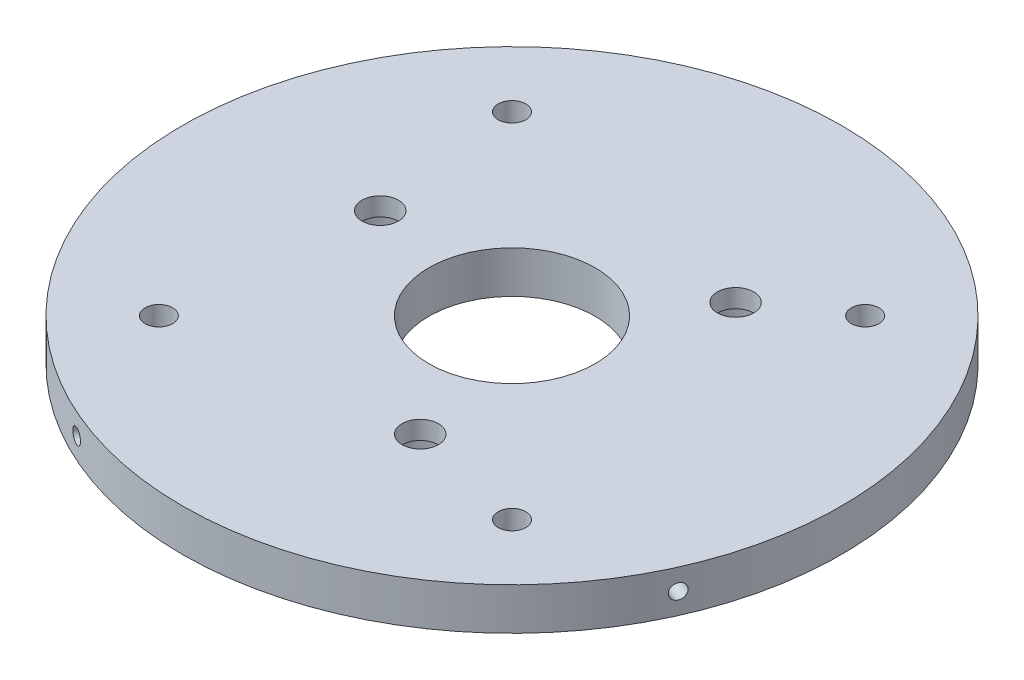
ISO-10303-21;
HEADER;
FILE_DESCRIPTION(('STEP AP214'),'2;1');
FILE_NAME('part.step','',(''),(''),'','','');
FILE_SCHEMA(('AUTOMOTIVE_DESIGN { 1 0 10303 214 1 1 1 1 }'));
ENDSEC;
DATA;
#1=APPLICATION_CONTEXT('core data for automotive mechanical design processes');
#2=APPLICATION_PROTOCOL_DEFINITION('international standard','automotive_design',2000,#1);
#3=PRODUCT_CONTEXT('',#1,'mechanical');
#4=PRODUCT('Part','Part','',(#3));
#5=PRODUCT_RELATED_PRODUCT_CATEGORY('part','',(#4));
#6=PRODUCT_DEFINITION_FORMATION('','',#4);
#7=PRODUCT_DEFINITION_CONTEXT('part definition',#1,'design');
#8=PRODUCT_DEFINITION('design','',#6,#7);
#9=PRODUCT_DEFINITION_SHAPE('','',#8);
#10=(LENGTH_UNIT() NAMED_UNIT(*) SI_UNIT(.MILLI.,.METRE.));
#11=(NAMED_UNIT(*) PLANE_ANGLE_UNIT() SI_UNIT($,.RADIAN.));
#12=(NAMED_UNIT(*) SI_UNIT($,.STERADIAN.) SOLID_ANGLE_UNIT());
#13=UNCERTAINTY_MEASURE_WITH_UNIT(LENGTH_MEASURE(1.E-05),#10,'distance_accuracy_value','');
#14=(GEOMETRIC_REPRESENTATION_CONTEXT(3) GLOBAL_UNCERTAINTY_ASSIGNED_CONTEXT((#13)) GLOBAL_UNIT_ASSIGNED_CONTEXT((#10,
#11,#12)) REPRESENTATION_CONTEXT('',''));
#15=CARTESIAN_POINT('',(0.,0.,0.));
#16=DIRECTION('',(0.,0.,1.));
#17=DIRECTION('',(1.,0.,0.));
#18=AXIS2_PLACEMENT_3D('',#15,#16,#17);
#19=CARTESIAN_POINT('',(0.,6.35,0.));
#20=DIRECTION('',(0.,1.,0.));
#21=DIRECTION('',(0.,0.,1.));
#22=AXIS2_PLACEMENT_3D('',#19,#20,#21);
#23=PLANE('',#22);
#24=CARTESIAN_POINT('',(15.1382985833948,6.35,-18.6234238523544));
#25=DIRECTION('',(0.,-1.,0.));
#26=DIRECTION('',(0.,0.,-1.));
#27=AXIS2_PLACEMENT_3D('',#24,#25,#26);
#28=CIRCLE('',#27,2.75);
#29=CARTESIAN_POINT('',(15.1382985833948,6.35,-21.3734238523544));
#30=VERTEX_POINT('',#29);
#31=EDGE_CURVE('E103',#30,#30,#28,.T.);
#32=ORIENTED_EDGE('',*,*,#31,.T.);
#33=EDGE_LOOP('',(#32));
#34=FACE_BOUND('',#33,.T.);
#35=CARTESIAN_POINT('',(8.55920886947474,6.35,22.4218630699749));
#36=DIRECTION('',(0.,-1.,0.));
#37=DIRECTION('',(0.,0.,-1.));
#38=AXIS2_PLACEMENT_3D('',#35,#36,#37);
#39=CIRCLE('',#38,2.75);
#40=CARTESIAN_POINT('',(8.55920886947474,6.35,19.6718630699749));
#41=VERTEX_POINT('',#40);
#42=EDGE_CURVE('E117',#41,#41,#39,.T.);
#43=ORIENTED_EDGE('',*,*,#42,.T.);
#44=EDGE_LOOP('',(#43));
#45=FACE_BOUND('',#44,.T.);
#46=CARTESIAN_POINT('',(-23.6975074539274,6.35,-3.79843921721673));
#47=DIRECTION('',(0.,-1.,0.));
#48=DIRECTION('',(0.,0.,-1.));
#49=AXIS2_PLACEMENT_3D('',#46,#47,#48);
#50=CIRCLE('',#49,2.75);
#51=CARTESIAN_POINT('',(-23.6975074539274,6.35,-6.54843921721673));
#52=VERTEX_POINT('',#51);
#53=EDGE_CURVE('E130',#52,#52,#50,.T.);
#54=ORIENTED_EDGE('',*,*,#53,.T.);
#55=EDGE_LOOP('',(#54));
#56=FACE_BOUND('',#55,.T.);
#57=CARTESIAN_POINT('',(-26.6700000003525,6.35,-26.6699999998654));
#58=DIRECTION('',(0.,1.,0.));
#59=DIRECTION('',(0.,0.,1.));
#60=AXIS2_PLACEMENT_3D('',#57,#58,#59);
#61=CIRCLE('',#60,2.0828);
#62=CARTESIAN_POINT('',(-26.6700000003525,6.35,-24.5871999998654));
#63=VERTEX_POINT('',#62);
#64=EDGE_CURVE('E133',#63,#63,#61,.T.);
#65=ORIENTED_EDGE('',*,*,#64,.F.);
#66=EDGE_LOOP('',(#65));
#67=FACE_BOUND('',#66,.T.);
#68=CARTESIAN_POINT('',(26.6699999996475,6.35,-26.6699999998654));
#69=DIRECTION('',(0.,1.,0.));
#70=DIRECTION('',(0.,0.,1.));
#71=AXIS2_PLACEMENT_3D('',#68,#69,#70);
#72=CIRCLE('',#71,2.0828);
#73=CARTESIAN_POINT('',(26.6699999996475,6.35,-24.5871999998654));
#74=VERTEX_POINT('',#73);
#75=EDGE_CURVE('E139',#74,#74,#72,.T.);
#76=ORIENTED_EDGE('',*,*,#75,.F.);
#77=EDGE_LOOP('',(#76));
#78=FACE_BOUND('',#77,.T.);
#79=CARTESIAN_POINT('',(-26.6700000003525,6.35,26.6700000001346));
#80=DIRECTION('',(0.,1.,0.));
#81=DIRECTION('',(0.,0.,1.));
#82=AXIS2_PLACEMENT_3D('',#79,#80,#81);
#83=CIRCLE('',#82,2.0828);
#84=CARTESIAN_POINT('',(-26.6700000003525,6.35,28.7528000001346));
#85=VERTEX_POINT('',#84);
#86=EDGE_CURVE('E145',#85,#85,#83,.T.);
#87=ORIENTED_EDGE('',*,*,#86,.F.);
#88=EDGE_LOOP('',(#87));
#89=FACE_BOUND('',#88,.T.);
#90=CARTESIAN_POINT('',(26.6699999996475,6.35,26.6700000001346));
#91=DIRECTION('',(0.,1.,0.));
#92=DIRECTION('',(0.,0.,1.));
#93=AXIS2_PLACEMENT_3D('',#90,#91,#92);
#94=CIRCLE('',#93,2.0828);
#95=CARTESIAN_POINT('',(26.6699999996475,6.35,28.7528000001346));
#96=VERTEX_POINT('',#95);
#97=EDGE_CURVE('E151',#96,#96,#94,.T.);
#98=ORIENTED_EDGE('',*,*,#97,.F.);
#99=EDGE_LOOP('',(#98));
#100=FACE_BOUND('',#99,.T.);
#101=CARTESIAN_POINT('',(0.,6.35,0.));
#102=DIRECTION('',(0.,1.,0.));
#103=DIRECTION('',(0.,0.,1.));
#104=AXIS2_PLACEMENT_3D('',#101,#102,#103);
#105=CIRCLE('',#104,49.7713);
#106=CARTESIAN_POINT('',(0.,6.35,49.7713));
#107=VERTEX_POINT('',#106);
#108=EDGE_CURVE('E165',#107,#107,#105,.T.);
#109=ORIENTED_EDGE('',*,*,#108,.T.);
#110=EDGE_LOOP('',(#109));
#111=FACE_BOUND('',#110,.T.);
#112=CARTESIAN_POINT('',(0.,6.35,0.));
#113=DIRECTION('',(0.,1.,0.));
#114=DIRECTION('',(0.,0.,1.));
#115=AXIS2_PLACEMENT_3D('',#112,#113,#114);
#116=CIRCLE('',#115,12.5603);
#117=CARTESIAN_POINT('',(0.,6.35,12.5603));
#118=VERTEX_POINT('',#117);
#119=EDGE_CURVE('E159',#118,#118,#116,.T.);
#120=ORIENTED_EDGE('',*,*,#119,.F.);
#121=EDGE_LOOP('',(#120));
#122=FACE_BOUND('',#121,.T.);
#123=ADVANCED_FACE('F44',(#34,#45,#56,#67,#78,#89,#100,#111,#122),#23,.T.);
#124=CARTESIAN_POINT('',(0.,0.,0.));
#125=DIRECTION('',(0.,1.,0.));
#126=DIRECTION('',(0.,0.,1.));
#127=AXIS2_PLACEMENT_3D('',#124,#125,#126);
#128=PLANE('',#127);
#129=CARTESIAN_POINT('',(15.1382985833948,0.,-18.6234238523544));
#130=DIRECTION('',(0.,-1.,0.));
#131=DIRECTION('',(0.,0.,-1.));
#132=AXIS2_PLACEMENT_3D('',#129,#130,#131);
#133=CIRCLE('',#132,6.12);
#134=CARTESIAN_POINT('',(15.1382985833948,0.,-24.7434238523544));
#135=VERTEX_POINT('',#134);
#136=EDGE_CURVE('E94',#135,#135,#133,.T.);
#137=ORIENTED_EDGE('',*,*,#136,.F.);
#138=EDGE_LOOP('',(#137));
#139=FACE_BOUND('',#138,.T.);
#140=CARTESIAN_POINT('',(8.55920886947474,0.,22.4218630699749));
#141=DIRECTION('',(0.,-1.,0.));
#142=DIRECTION('',(0.,0.,-1.));
#143=AXIS2_PLACEMENT_3D('',#140,#141,#142);
#144=CIRCLE('',#143,6.12);
#145=CARTESIAN_POINT('',(8.55920886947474,0.,16.3018630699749));
#146=VERTEX_POINT('',#145);
#147=EDGE_CURVE('E106',#146,#146,#144,.T.);
#148=ORIENTED_EDGE('',*,*,#147,.F.);
#149=EDGE_LOOP('',(#148));
#150=FACE_BOUND('',#149,.T.);
#151=CARTESIAN_POINT('',(-23.6975074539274,0.,-3.79843921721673));
#152=DIRECTION('',(0.,-1.,0.));
#153=DIRECTION('',(0.,0.,-1.));
#154=AXIS2_PLACEMENT_3D('',#151,#152,#153);
#155=CIRCLE('',#154,6.12);
#156=CARTESIAN_POINT('',(-23.6975074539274,0.,-9.91843921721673));
#157=VERTEX_POINT('',#156);
#158=EDGE_CURVE('E121',#157,#157,#155,.T.);
#159=ORIENTED_EDGE('',*,*,#158,.F.);
#160=EDGE_LOOP('',(#159));
#161=FACE_BOUND('',#160,.T.);
#162=CARTESIAN_POINT('',(-26.6700000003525,0.,-26.6699999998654));
#163=DIRECTION('',(0.,1.,0.));
#164=DIRECTION('',(0.,0.,1.));
#165=AXIS2_PLACEMENT_3D('',#162,#163,#164);
#166=CIRCLE('',#165,2.0828);
#167=CARTESIAN_POINT('',(-26.6700000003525,0.,-24.5871999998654));
#168=VERTEX_POINT('',#167);
#169=EDGE_CURVE('E136',#168,#168,#166,.T.);
#170=ORIENTED_EDGE('',*,*,#169,.T.);
#171=EDGE_LOOP('',(#170));
#172=FACE_BOUND('',#171,.T.);
#173=CARTESIAN_POINT('',(26.6699999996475,0.,-26.6699999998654));
#174=DIRECTION('',(0.,1.,0.));
#175=DIRECTION('',(0.,0.,1.));
#176=AXIS2_PLACEMENT_3D('',#173,#174,#175);
#177=CIRCLE('',#176,2.0828);
#178=CARTESIAN_POINT('',(26.6699999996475,0.,-24.5871999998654));
#179=VERTEX_POINT('',#178);
#180=EDGE_CURVE('E142',#179,#179,#177,.T.);
#181=ORIENTED_EDGE('',*,*,#180,.T.);
#182=EDGE_LOOP('',(#181));
#183=FACE_BOUND('',#182,.T.);
#184=CARTESIAN_POINT('',(-26.6700000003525,0.,26.6700000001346));
#185=DIRECTION('',(0.,1.,0.));
#186=DIRECTION('',(0.,0.,1.));
#187=AXIS2_PLACEMENT_3D('',#184,#185,#186);
#188=CIRCLE('',#187,2.0828);
#189=CARTESIAN_POINT('',(-26.6700000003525,0.,28.7528000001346));
#190=VERTEX_POINT('',#189);
#191=EDGE_CURVE('E148',#190,#190,#188,.T.);
#192=ORIENTED_EDGE('',*,*,#191,.T.);
#193=EDGE_LOOP('',(#192));
#194=FACE_BOUND('',#193,.T.);
#195=CARTESIAN_POINT('',(26.6699999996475,0.,26.6700000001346));
#196=DIRECTION('',(0.,1.,0.));
#197=DIRECTION('',(0.,0.,1.));
#198=AXIS2_PLACEMENT_3D('',#195,#196,#197);
#199=CIRCLE('',#198,2.0828);
#200=CARTESIAN_POINT('',(26.6699999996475,0.,28.7528000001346));
#201=VERTEX_POINT('',#200);
#202=EDGE_CURVE('E155',#201,#201,#199,.T.);
#203=ORIENTED_EDGE('',*,*,#202,.T.);
#204=EDGE_LOOP('',(#203));
#205=FACE_BOUND('',#204,.T.);
#206=CARTESIAN_POINT('',(0.,0.,0.));
#207=DIRECTION('',(0.,1.,0.));
#208=DIRECTION('',(0.,0.,1.));
#209=AXIS2_PLACEMENT_3D('',#206,#207,#208);
#210=CIRCLE('',#209,49.7713);
#211=CARTESIAN_POINT('',(0.,0.,49.7713));
#212=VERTEX_POINT('',#211);
#213=EDGE_CURVE('E162',#212,#212,#210,.T.);
#214=ORIENTED_EDGE('',*,*,#213,.F.);
#215=EDGE_LOOP('',(#214));
#216=FACE_BOUND('',#215,.T.);
#217=CARTESIAN_POINT('',(0.,0.,0.));
#218=DIRECTION('',(0.,1.,0.));
#219=DIRECTION('',(0.,0.,1.));
#220=AXIS2_PLACEMENT_3D('',#217,#218,#219);
#221=CIRCLE('',#220,12.5603);
#222=CARTESIAN_POINT('',(0.,0.,12.5603));
#223=VERTEX_POINT('',#222);
#224=EDGE_CURVE('E158',#223,#223,#221,.T.);
#225=ORIENTED_EDGE('',*,*,#224,.T.);
#226=EDGE_LOOP('',(#225));
#227=FACE_BOUND('',#226,.T.);
#228=ADVANCED_FACE('F251',(#139,#150,#161,#172,#183,#194,#205,#216,#227),#128,.F.);
#229=CARTESIAN_POINT('',(0.,6.35,0.));
#230=DIRECTION('',(0.,-1.,0.));
#231=DIRECTION('',(0.,0.,-1.));
#232=AXIS2_PLACEMENT_3D('',#229,#230,#231);
#233=CYLINDRICAL_SURFACE('',#232,49.7713);
#234=CARTESIAN_POINT('',(45.8793955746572,3.175,19.2941277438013));
#235=CARTESIAN_POINT('',(45.8793945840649,3.11151933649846,19.2941303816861));
#236=CARTESIAN_POINT('',(45.8773157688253,3.04799285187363,19.2990756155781));
#237=CARTESIAN_POINT('',(45.8690427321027,2.92269003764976,19.3187300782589));
#238=CARTESIAN_POINT('',(45.862843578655,2.86091589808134,19.3334510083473));
#239=CARTESIAN_POINT('',(45.8464791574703,2.74095119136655,19.3722247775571));
#240=CARTESIAN_POINT('',(45.8363158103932,2.68275890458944,19.3962730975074));
#241=CARTESIAN_POINT('',(45.812272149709,2.57159852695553,19.4529938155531));
#242=CARTESIAN_POINT('',(45.7983927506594,2.51862915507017,19.4856640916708));
#243=CARTESIAN_POINT('',(45.7672534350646,2.41938469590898,19.5586908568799));
#244=CARTESIAN_POINT('',(45.7499926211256,2.37311139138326,19.5990493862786));
#245=CARTESIAN_POINT('',(45.7125254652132,2.28858743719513,19.6862786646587));
#246=CARTESIAN_POINT('',(45.6923190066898,2.25033710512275,19.7331496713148));
#247=CARTESIAN_POINT('',(45.6494782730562,2.18294378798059,19.8320532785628));
#248=CARTESIAN_POINT('',(45.6268437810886,2.15380161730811,19.8840863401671));
#249=CARTESIAN_POINT('',(45.5797451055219,2.105457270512,19.9918131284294));
#250=CARTESIAN_POINT('',(45.5552809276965,2.08625506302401,20.0475068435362));
#251=CARTESIAN_POINT('',(45.5051894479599,2.05833885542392,20.1609493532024));
#252=CARTESIAN_POINT('',(45.4795623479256,2.04962304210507,20.2186977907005));
#253=CARTESIAN_POINT('',(45.4278535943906,2.04292145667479,20.3346120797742));
#254=CARTESIAN_POINT('',(45.4017719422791,2.04493565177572,20.3927779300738));
#255=CARTESIAN_POINT('',(45.3499030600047,2.05963534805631,20.5078663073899));
#256=CARTESIAN_POINT('',(45.3241157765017,2.07231888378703,20.5647890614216));
#257=CARTESIAN_POINT('',(45.2735845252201,2.10799418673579,20.6757967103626));
#258=CARTESIAN_POINT('',(45.2488405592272,2.13098597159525,20.7298816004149));
#259=CARTESIAN_POINT('',(45.2011335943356,2.18662736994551,20.8337009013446));
#260=CARTESIAN_POINT('',(45.1781707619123,2.21927788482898,20.8834349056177));
#261=CARTESIAN_POINT('',(45.1347294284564,2.29330922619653,20.9771584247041));
#262=CARTESIAN_POINT('',(45.1142509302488,2.3346900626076,21.0211479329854));
#263=CARTESIAN_POINT('',(45.0764103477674,2.42501852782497,21.1021690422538));
#264=CARTESIAN_POINT('',(45.059048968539,2.47396786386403,21.1391990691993));
#265=CARTESIAN_POINT('',(45.0279964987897,2.57803779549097,21.2052628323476));
#266=CARTESIAN_POINT('',(45.0143054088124,2.63315839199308,21.2342965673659));
#267=CARTESIAN_POINT('',(44.9910312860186,2.74800710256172,21.2835653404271));
#268=CARTESIAN_POINT('',(44.9814482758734,2.80773524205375,21.3038003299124));
#269=CARTESIAN_POINT('',(44.966699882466,2.93010312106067,21.3349128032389));
#270=CARTESIAN_POINT('',(44.9615344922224,2.99274285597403,21.3457903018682));
#271=CARTESIAN_POINT('',(44.955789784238,3.11914079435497,21.357886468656));
#272=CARTESIAN_POINT('',(44.9552094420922,3.18289874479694,21.3591072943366));
#273=CARTESIAN_POINT('',(44.9586510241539,3.30973640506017,21.3518621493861));
#274=CARTESIAN_POINT('',(44.9626729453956,3.37281611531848,21.3433961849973));
#275=CARTESIAN_POINT('',(44.9751876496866,3.49650001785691,21.3170122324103));
#276=CARTESIAN_POINT('',(44.9836799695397,3.55710446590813,21.299095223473));
#277=CARTESIAN_POINT('',(45.0048606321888,3.67412532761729,21.2543038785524));
#278=CARTESIAN_POINT('',(45.0175489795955,3.73054173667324,21.2274295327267));
#279=CARTESIAN_POINT('',(45.0467176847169,3.83759604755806,21.165460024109));
#280=CARTESIAN_POINT('',(45.0631987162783,3.88823292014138,21.1303634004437));
#281=CARTESIAN_POINT('',(45.0994295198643,3.98228041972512,21.052923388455));
#282=CARTESIAN_POINT('',(45.1191792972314,4.02569103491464,21.0105799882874));
#283=CARTESIAN_POINT('',(45.1613350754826,4.10406168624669,20.9198139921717));
#284=CARTESIAN_POINT('',(45.183741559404,4.13902018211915,20.8713902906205));
#285=CARTESIAN_POINT('',(45.2305203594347,4.19948369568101,20.7698207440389));
#286=CARTESIAN_POINT('',(45.2548926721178,4.22498872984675,20.7166749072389));
#287=CARTESIAN_POINT('',(45.3048675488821,4.26581863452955,20.6071565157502));
#288=CARTESIAN_POINT('',(45.3304699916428,4.28114450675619,20.5507842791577));
#289=CARTESIAN_POINT('',(45.3821541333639,4.30118433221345,20.436397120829));
#290=CARTESIAN_POINT('',(45.4082358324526,4.3058982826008,20.3783821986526));
#291=CARTESIAN_POINT('',(45.4601234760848,4.30458031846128,20.2623669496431));
#292=CARTESIAN_POINT('',(45.4859294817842,4.29855083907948,20.204366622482));
#293=CARTESIAN_POINT('',(45.5365498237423,4.27592216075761,20.0900185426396));
#294=CARTESIAN_POINT('',(45.5613641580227,4.25932294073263,20.0336707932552));
#295=CARTESIAN_POINT('',(45.60932562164,4.21602613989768,19.9242388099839));
#296=CARTESIAN_POINT('',(45.6324727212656,4.18932837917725,19.8711546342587));
#297=CARTESIAN_POINT('',(45.6764846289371,4.12659367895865,19.7697777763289));
#298=CARTESIAN_POINT('',(45.6973495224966,4.09055708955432,19.7214849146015));
#299=CARTESIAN_POINT('',(45.7362612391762,4.01016238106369,19.631075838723));
#300=CARTESIAN_POINT('',(45.7543077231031,3.96580326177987,19.588960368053));
#301=CARTESIAN_POINT('',(45.7871282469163,3.87001039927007,19.5121229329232));
#302=CARTESIAN_POINT('',(45.8019014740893,3.81857490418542,19.4774028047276));
#303=CARTESIAN_POINT('',(45.827811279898,3.71007401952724,19.4163621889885));
#304=CARTESIAN_POINT('',(45.8389457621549,3.65300540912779,19.390046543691));
#305=CARTESIAN_POINT('',(45.8572852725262,3.53492493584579,19.3466341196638));
#306=CARTESIAN_POINT('',(45.8644949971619,3.47391788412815,19.3295263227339));
#307=CARTESIAN_POINT('',(45.8728972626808,3.37293665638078,19.3095744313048));
#308=CARTESIAN_POINT('',(45.8753314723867,3.33361823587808,19.3037893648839));
#309=CARTESIAN_POINT('',(45.8785809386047,3.25453920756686,19.296065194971));
#310=CARTESIAN_POINT('',(45.8793961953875,3.2147785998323,19.2941260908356));
#311=CARTESIAN_POINT('',(45.8793955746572,3.175,19.2941277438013));
#312=B_SPLINE_CURVE_WITH_KNOTS('',3,(#234,#235,#236,#237,#238,#239,#240,#241,#242,#243,#244,
#245,#246,#247,#248,#249,#250,#251,#252,#253,#254,#255,#256,#257,#258,#259,#260,#261,#262,#263,
#264,#265,#266,#267,#268,#269,#270,#271,#272,#273,#274,#275,#276,#277,#278,#279,#280,#281,#282,
#283,#284,#285,#286,#287,#288,#289,#290,#291,#292,#293,#294,#295,#296,#297,#298,#299,#300,#301,
#302,#303,#304,#305,#306,#307,#308,#309,#310,#311),.UNSPECIFIED.,.T.,.F.,(4,2,2,2,2,2,2,2,2,2,2,
2,2,2,2,2,2,2,2,2,2,2,2,2,2,2,2,2,2,2,2,2,2,2,2,2,2,2,4),(0.,0.190296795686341,
0.380821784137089,0.571254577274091,0.761640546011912,0.952077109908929,1.1425212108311,
1.33298233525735,1.52344285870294,1.71387044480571,1.90429744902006,2.09468938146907,
2.28508163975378,2.47549167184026,2.66590192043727,2.85635518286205,3.04680847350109,
3.23726281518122,3.42771685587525,3.61812834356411,3.80853970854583,3.9989313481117,
4.18932319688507,4.37974889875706,4.57017491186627,4.76063560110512,4.95109595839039,
5.14153757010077,5.33197923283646,5.52237773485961,5.71277661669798,5.90317889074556,
6.09357402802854,6.28399206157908,6.47445732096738,6.665032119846,6.85537836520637,
6.97462320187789,7.09386801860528),.UNSPECIFIED.);
#313=CARTESIAN_POINT('',(45.8793955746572,3.175,19.2941277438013));
#314=VERTEX_POINT('',#313);
#315=EDGE_CURVE('E11',#314,#314,#312,.T.);
#316=ORIENTED_EDGE('',*,*,#315,.T.);
#317=EDGE_LOOP('',(#316));
#318=FACE_BOUND('',#317,.T.);
#319=CARTESIAN_POINT('',(19.2941277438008,3.175,-45.8793955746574));
#320=CARTESIAN_POINT('',(19.2941303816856,3.11151933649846,-45.8793945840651));
#321=CARTESIAN_POINT('',(19.2990756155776,3.04799285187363,-45.8773157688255));
#322=CARTESIAN_POINT('',(19.3187300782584,2.92269003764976,-45.8690427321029));
#323=CARTESIAN_POINT('',(19.3334510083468,2.86091589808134,-45.8628435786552));
#324=CARTESIAN_POINT('',(19.3722247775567,2.74095119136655,-45.8464791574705));
#325=CARTESIAN_POINT('',(19.3962730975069,2.68275890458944,-45.8363158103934));
#326=CARTESIAN_POINT('',(19.4529938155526,2.57159852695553,-45.8122721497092));
#327=CARTESIAN_POINT('',(19.4856640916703,2.51862915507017,-45.7983927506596));
#328=CARTESIAN_POINT('',(19.5586908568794,2.41938469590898,-45.7672534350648));
#329=CARTESIAN_POINT('',(19.5990493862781,2.37311139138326,-45.7499926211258));
#330=CARTESIAN_POINT('',(19.6862786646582,2.28858743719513,-45.7125254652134));
#331=CARTESIAN_POINT('',(19.7331496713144,2.25033710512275,-45.69231900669));
#332=CARTESIAN_POINT('',(19.8320532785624,2.18294378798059,-45.6494782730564));
#333=CARTESIAN_POINT('',(19.8840863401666,2.15380161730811,-45.6268437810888));
#334=CARTESIAN_POINT('',(19.9918131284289,2.105457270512,-45.5797451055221));
#335=CARTESIAN_POINT('',(20.0475068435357,2.08625506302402,-45.5552809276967));
#336=CARTESIAN_POINT('',(20.1609493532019,2.05833885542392,-45.5051894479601));
#337=CARTESIAN_POINT('',(20.2186977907,2.04962304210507,-45.4795623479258));
#338=CARTESIAN_POINT('',(20.3346120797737,2.04292145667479,-45.4278535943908));
#339=CARTESIAN_POINT('',(20.3927779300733,2.04493565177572,-45.4017719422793));
#340=CARTESIAN_POINT('',(20.5078663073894,2.05963534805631,-45.349903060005));
#341=CARTESIAN_POINT('',(20.5647890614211,2.07231888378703,-45.3241157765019));
#342=CARTESIAN_POINT('',(20.6757967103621,2.10799418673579,-45.2735845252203));
#343=CARTESIAN_POINT('',(20.7298816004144,2.13098597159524,-45.2488405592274));
#344=CARTESIAN_POINT('',(20.8337009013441,2.18662736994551,-45.2011335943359));
#345=CARTESIAN_POINT('',(20.8834349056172,2.21927788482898,-45.1781707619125));
#346=CARTESIAN_POINT('',(20.9771584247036,2.29330922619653,-45.1347294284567));
#347=CARTESIAN_POINT('',(21.0211479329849,2.33469006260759,-45.114250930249));
#348=CARTESIAN_POINT('',(21.1021690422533,2.42501852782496,-45.0764103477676));
#349=CARTESIAN_POINT('',(21.1391990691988,2.47396786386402,-45.0590489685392));
#350=CARTESIAN_POINT('',(21.2052628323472,2.57803779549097,-45.0279964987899));
#351=CARTESIAN_POINT('',(21.2342965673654,2.63315839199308,-45.0143054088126));
#352=CARTESIAN_POINT('',(21.2835653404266,2.74800710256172,-44.9910312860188));
#353=CARTESIAN_POINT('',(21.3038003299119,2.80773524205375,-44.9814482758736));
#354=CARTESIAN_POINT('',(21.3349128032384,2.93010312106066,-44.9666998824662));
#355=CARTESIAN_POINT('',(21.3457903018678,2.99274285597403,-44.9615344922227));
#356=CARTESIAN_POINT('',(21.3578864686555,3.11914079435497,-44.9557897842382));
#357=CARTESIAN_POINT('',(21.3591072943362,3.18289874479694,-44.9552094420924));
#358=CARTESIAN_POINT('',(21.3518621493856,3.30973640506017,-44.9586510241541));
#359=CARTESIAN_POINT('',(21.3433961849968,3.37281611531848,-44.9626729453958));
#360=CARTESIAN_POINT('',(21.3170122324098,3.49650001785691,-44.9751876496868));
#361=CARTESIAN_POINT('',(21.2990952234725,3.55710446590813,-44.9836799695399));
#362=CARTESIAN_POINT('',(21.254303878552,3.67412532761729,-45.0048606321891));
#363=CARTESIAN_POINT('',(21.2274295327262,3.73054173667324,-45.0175489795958));
#364=CARTESIAN_POINT('',(21.1654600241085,3.83759604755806,-45.0467176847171));
#365=CARTESIAN_POINT('',(21.1303634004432,3.88823292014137,-45.0631987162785));
#366=CARTESIAN_POINT('',(21.0529233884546,3.98228041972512,-45.0994295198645));
#367=CARTESIAN_POINT('',(21.010579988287,4.02569103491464,-45.1191792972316));
#368=CARTESIAN_POINT('',(20.9198139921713,4.10406168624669,-45.1613350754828));
#369=CARTESIAN_POINT('',(20.87139029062,4.13902018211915,-45.1837415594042));
#370=CARTESIAN_POINT('',(20.7698207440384,4.19948369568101,-45.2305203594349));
#371=CARTESIAN_POINT('',(20.7166749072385,4.22498872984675,-45.254892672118));
#372=CARTESIAN_POINT('',(20.6071565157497,4.26581863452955,-45.3048675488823));
#373=CARTESIAN_POINT('',(20.5507842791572,4.28114450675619,-45.330469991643));
#374=CARTESIAN_POINT('',(20.4363971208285,4.30118433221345,-45.3821541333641));
#375=CARTESIAN_POINT('',(20.3783821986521,4.3058982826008,-45.4082358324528));
#376=CARTESIAN_POINT('',(20.2623669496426,4.30458031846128,-45.460123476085));
#377=CARTESIAN_POINT('',(20.2043666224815,4.29855083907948,-45.4859294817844));
#378=CARTESIAN_POINT('',(20.0900185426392,4.27592216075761,-45.5365498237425));
#379=CARTESIAN_POINT('',(20.0336707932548,4.25932294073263,-45.5613641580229));
#380=CARTESIAN_POINT('',(19.9242388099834,4.21602613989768,-45.6093256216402));
#381=CARTESIAN_POINT('',(19.8711546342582,4.18932837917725,-45.6324727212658));
#382=CARTESIAN_POINT('',(19.7697777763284,4.12659367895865,-45.6764846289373));
#383=CARTESIAN_POINT('',(19.721484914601,4.09055708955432,-45.6973495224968));
#384=CARTESIAN_POINT('',(19.6310758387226,4.01016238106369,-45.7362612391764));
#385=CARTESIAN_POINT('',(19.5889603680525,3.96580326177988,-45.7543077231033));
#386=CARTESIAN_POINT('',(19.5121229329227,3.87001039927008,-45.7871282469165));
#387=CARTESIAN_POINT('',(19.4774028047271,3.81857490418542,-45.8019014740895));
#388=CARTESIAN_POINT('',(19.416362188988,3.71007401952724,-45.8278112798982));
#389=CARTESIAN_POINT('',(19.3900465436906,3.65300540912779,-45.8389457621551));
#390=CARTESIAN_POINT('',(19.3466341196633,3.5349249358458,-45.8572852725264));
#391=CARTESIAN_POINT('',(19.3295263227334,3.47391788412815,-45.8644949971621));
#392=CARTESIAN_POINT('',(19.3095744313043,3.37293665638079,-45.872897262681));
#393=CARTESIAN_POINT('',(19.3037893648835,3.33361823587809,-45.8753314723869));
#394=CARTESIAN_POINT('',(19.2960651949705,3.25453920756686,-45.8785809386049));
#395=CARTESIAN_POINT('',(19.2941260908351,3.2147785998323,-45.8793961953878));
#396=CARTESIAN_POINT('',(19.2941277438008,3.175,-45.8793955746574));
#397=B_SPLINE_CURVE_WITH_KNOTS('',3,(#319,#320,#321,#322,#323,#324,#325,#326,#327,#328,#329,
#330,#331,#332,#333,#334,#335,#336,#337,#338,#339,#340,#341,#342,#343,#344,#345,#346,#347,#348,
#349,#350,#351,#352,#353,#354,#355,#356,#357,#358,#359,#360,#361,#362,#363,#364,#365,#366,#367,
#368,#369,#370,#371,#372,#373,#374,#375,#376,#377,#378,#379,#380,#381,#382,#383,#384,#385,#386,
#387,#388,#389,#390,#391,#392,#393,#394,#395,#396),.UNSPECIFIED.,.T.,.F.,(4,2,2,2,2,2,2,2,2,2,2,
2,2,2,2,2,2,2,2,2,2,2,2,2,2,2,2,2,2,2,2,2,2,2,2,2,2,2,4),(0.,0.19029679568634,0.380821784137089,
0.57125457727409,0.76164054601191,0.952077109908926,1.1425212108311,1.33298233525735,
1.52344285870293,1.7138704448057,1.90429744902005,2.09468938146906,2.28508163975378,
2.47549167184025,2.66590192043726,2.85635518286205,3.04680847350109,3.23726281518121,
3.42771685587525,3.61812834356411,3.80853970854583,3.9989313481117,4.18932319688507,
4.37974889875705,4.57017491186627,4.76063560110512,4.95109595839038,5.14153757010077,
5.33197923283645,5.5223777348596,5.71277661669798,5.90317889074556,6.09357402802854,
6.28399206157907,6.47445732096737,6.665032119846,6.85537836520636,6.97462320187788,
7.09386801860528),.UNSPECIFIED.);
#398=CARTESIAN_POINT('',(19.2941277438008,3.175,-45.8793955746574));
#399=VERTEX_POINT('',#398);
#400=EDGE_CURVE('E56',#399,#399,#397,.T.);
#401=ORIENTED_EDGE('',*,*,#400,.T.);
#402=EDGE_LOOP('',(#401));
#403=FACE_BOUND('',#402,.T.);
#404=CARTESIAN_POINT('',(-45.8793955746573,3.175,-19.294127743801));
#405=CARTESIAN_POINT('',(-45.8793945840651,3.11151933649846,-19.2941303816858));
#406=CARTESIAN_POINT('',(-45.8773157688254,3.04799285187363,-19.2990756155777));
#407=CARTESIAN_POINT('',(-45.8690427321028,2.92269003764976,-19.3187300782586));
#408=CARTESIAN_POINT('',(-45.8628435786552,2.86091589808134,-19.333451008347));
#409=CARTESIAN_POINT('',(-45.8464791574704,2.74095119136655,-19.3722247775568));
#410=CARTESIAN_POINT('',(-45.8363158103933,2.68275890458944,-19.3962730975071));
#411=CARTESIAN_POINT('',(-45.8122721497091,2.57159852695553,-19.4529938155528));
#412=CARTESIAN_POINT('',(-45.7983927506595,2.51862915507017,-19.4856640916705));
#413=CARTESIAN_POINT('',(-45.7672534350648,2.41938469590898,-19.5586908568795));
#414=CARTESIAN_POINT('',(-45.7499926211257,2.37311139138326,-19.5990493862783));
#415=CARTESIAN_POINT('',(-45.7125254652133,2.28858743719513,-19.6862786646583));
#416=CARTESIAN_POINT('',(-45.69231900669,2.25033710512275,-19.7331496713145));
#417=CARTESIAN_POINT('',(-45.6494782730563,2.18294378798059,-19.8320532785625));
#418=CARTESIAN_POINT('',(-45.6268437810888,2.15380161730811,-19.8840863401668));
#419=CARTESIAN_POINT('',(-45.5797451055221,2.105457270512,-19.9918131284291));
#420=CARTESIAN_POINT('',(-45.5552809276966,2.08625506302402,-20.0475068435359));
#421=CARTESIAN_POINT('',(-45.5051894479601,2.05833885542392,-20.160949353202));
#422=CARTESIAN_POINT('',(-45.4795623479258,2.04962304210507,-20.2186977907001));
#423=CARTESIAN_POINT('',(-45.4278535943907,2.04292145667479,-20.3346120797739));
#424=CARTESIAN_POINT('',(-45.4017719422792,2.04493565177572,-20.3927779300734));
#425=CARTESIAN_POINT('',(-45.3499030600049,2.05963534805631,-20.5078663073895));
#426=CARTESIAN_POINT('',(-45.3241157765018,2.07231888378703,-20.5647890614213));
#427=CARTESIAN_POINT('',(-45.2735845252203,2.10799418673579,-20.6757967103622));
#428=CARTESIAN_POINT('',(-45.2488405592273,2.13098597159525,-20.7298816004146));
#429=CARTESIAN_POINT('',(-45.2011335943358,2.18662736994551,-20.8337009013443));
#430=CARTESIAN_POINT('',(-45.1781707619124,2.21927788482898,-20.8834349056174));
#431=CARTESIAN_POINT('',(-45.1347294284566,2.29330922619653,-20.9771584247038));
#432=CARTESIAN_POINT('',(-45.1142509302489,2.3346900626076,-21.0211479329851));
#433=CARTESIAN_POINT('',(-45.0764103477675,2.42501852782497,-21.1021690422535));
#434=CARTESIAN_POINT('',(-45.0590489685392,2.47396786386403,-21.139199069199));
#435=CARTESIAN_POINT('',(-45.0279964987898,2.57803779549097,-21.2052628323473));
#436=CARTESIAN_POINT('',(-45.0143054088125,2.63315839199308,-21.2342965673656));
#437=CARTESIAN_POINT('',(-44.9910312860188,2.74800710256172,-21.2835653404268));
#438=CARTESIAN_POINT('',(-44.9814482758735,2.80773524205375,-21.3038003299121));
#439=CARTESIAN_POINT('',(-44.9666998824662,2.93010312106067,-21.3349128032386));
#440=CARTESIAN_POINT('',(-44.9615344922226,2.99274285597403,-21.3457903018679));
#441=CARTESIAN_POINT('',(-44.9557897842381,3.11914079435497,-21.3578864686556));
#442=CARTESIAN_POINT('',(-44.9552094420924,3.18289874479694,-21.3591072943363));
#443=CARTESIAN_POINT('',(-44.9586510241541,3.30973640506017,-21.3518621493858));
#444=CARTESIAN_POINT('',(-44.9626729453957,3.37281611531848,-21.343396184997));
#445=CARTESIAN_POINT('',(-44.9751876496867,3.49650001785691,-21.31701223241));
#446=CARTESIAN_POINT('',(-44.9836799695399,3.55710446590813,-21.2990952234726));
#447=CARTESIAN_POINT('',(-45.004860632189,3.67412532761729,-21.2543038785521));
#448=CARTESIAN_POINT('',(-45.0175489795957,3.73054173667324,-21.2274295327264));
#449=CARTESIAN_POINT('',(-45.046717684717,3.83759604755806,-21.1654600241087));
#450=CARTESIAN_POINT('',(-45.0631987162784,3.88823292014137,-21.1303634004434));
#451=CARTESIAN_POINT('',(-45.0994295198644,3.98228041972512,-21.0529233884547));
#452=CARTESIAN_POINT('',(-45.1191792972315,4.02569103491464,-21.0105799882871));
#453=CARTESIAN_POINT('',(-45.1613350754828,4.10406168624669,-20.9198139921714));
#454=CARTESIAN_POINT('',(-45.1837415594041,4.13902018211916,-20.8713902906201));
#455=CARTESIAN_POINT('',(-45.2305203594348,4.19948369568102,-20.7698207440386));
#456=CARTESIAN_POINT('',(-45.254892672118,4.22498872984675,-20.7166749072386));
#457=CARTESIAN_POINT('',(-45.3048675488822,4.26581863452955,-20.6071565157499));
#458=CARTESIAN_POINT('',(-45.330469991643,4.28114450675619,-20.5507842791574));
#459=CARTESIAN_POINT('',(-45.382154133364,4.30118433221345,-20.4363971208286));
#460=CARTESIAN_POINT('',(-45.4082358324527,4.3058982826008,-20.3783821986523));
#461=CARTESIAN_POINT('',(-45.4601234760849,4.30458031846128,-20.2623669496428));
#462=CARTESIAN_POINT('',(-45.4859294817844,4.29855083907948,-20.2043666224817));
#463=CARTESIAN_POINT('',(-45.5365498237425,4.27592216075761,-20.0900185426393));
#464=CARTESIAN_POINT('',(-45.5613641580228,4.25932294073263,-20.0336707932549));
#465=CARTESIAN_POINT('',(-45.6093256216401,4.21602613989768,-19.9242388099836));
#466=CARTESIAN_POINT('',(-45.6324727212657,4.18932837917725,-19.8711546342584));
#467=CARTESIAN_POINT('',(-45.6764846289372,4.12659367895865,-19.7697777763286));
#468=CARTESIAN_POINT('',(-45.6973495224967,4.09055708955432,-19.7214849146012));
#469=CARTESIAN_POINT('',(-45.7362612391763,4.01016238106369,-19.6310758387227));
#470=CARTESIAN_POINT('',(-45.7543077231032,3.96580326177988,-19.5889603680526));
#471=CARTESIAN_POINT('',(-45.7871282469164,3.87001039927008,-19.5121229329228));
#472=CARTESIAN_POINT('',(-45.8019014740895,3.81857490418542,-19.4774028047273));
#473=CARTESIAN_POINT('',(-45.8278112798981,3.71007401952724,-19.4163621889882));
#474=CARTESIAN_POINT('',(-45.8389457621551,3.65300540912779,-19.3900465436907));
#475=CARTESIAN_POINT('',(-45.8572852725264,3.53492493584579,-19.3466341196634));
#476=CARTESIAN_POINT('',(-45.864494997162,3.47391788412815,-19.3295263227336));
#477=CARTESIAN_POINT('',(-45.8728972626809,3.37293665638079,-19.3095744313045));
#478=CARTESIAN_POINT('',(-45.8753314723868,3.33361823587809,-19.3037893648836));
#479=CARTESIAN_POINT('',(-45.8785809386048,3.25453920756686,-19.2960651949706));
#480=CARTESIAN_POINT('',(-45.8793961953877,3.2147785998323,-19.2941260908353));
#481=CARTESIAN_POINT('',(-45.8793955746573,3.175,-19.294127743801));
#482=B_SPLINE_CURVE_WITH_KNOTS('',3,(#404,#405,#406,#407,#408,#409,#410,#411,#412,#413,#414,
#415,#416,#417,#418,#419,#420,#421,#422,#423,#424,#425,#426,#427,#428,#429,#430,#431,#432,#433,
#434,#435,#436,#437,#438,#439,#440,#441,#442,#443,#444,#445,#446,#447,#448,#449,#450,#451,#452,
#453,#454,#455,#456,#457,#458,#459,#460,#461,#462,#463,#464,#465,#466,#467,#468,#469,#470,#471,
#472,#473,#474,#475,#476,#477,#478,#479,#480,#481),.UNSPECIFIED.,.T.,.F.,(4,2,2,2,2,2,2,2,2,2,2,
2,2,2,2,2,2,2,2,2,2,2,2,2,2,2,2,2,2,2,2,2,2,2,2,2,2,2,4),(0.,0.190296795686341,
0.380821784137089,0.571254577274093,0.761640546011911,0.952077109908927,1.1425212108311,
1.33298233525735,1.52344285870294,1.7138704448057,1.90429744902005,2.09468938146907,
2.28508163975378,2.47549167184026,2.66590192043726,2.85635518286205,3.04680847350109,
3.23726281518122,3.42771685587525,3.61812834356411,3.80853970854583,3.9989313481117,
4.18932319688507,4.37974889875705,4.57017491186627,4.76063560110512,4.95109595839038,
5.14153757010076,5.33197923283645,5.5223777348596,5.71277661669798,5.90317889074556,
6.09357402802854,6.28399206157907,6.47445732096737,6.665032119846,6.85537836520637,
6.97462320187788,7.09386801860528),.UNSPECIFIED.);
#483=CARTESIAN_POINT('',(-45.8793955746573,3.175,-19.294127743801));
#484=VERTEX_POINT('',#483);
#485=EDGE_CURVE('E179',#484,#484,#482,.T.);
#486=ORIENTED_EDGE('',*,*,#485,.T.);
#487=EDGE_LOOP('',(#486));
#488=FACE_BOUND('',#487,.T.);
#489=CARTESIAN_POINT('',(-19.2941277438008,3.175,45.8793955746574));
#490=CARTESIAN_POINT('',(-19.2941303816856,3.11151933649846,45.8793945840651));
#491=CARTESIAN_POINT('',(-19.2990756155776,3.04799285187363,45.8773157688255));
#492=CARTESIAN_POINT('',(-19.3187300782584,2.92269003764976,45.8690427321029));
#493=CARTESIAN_POINT('',(-19.3334510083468,2.86091589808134,45.8628435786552));
#494=CARTESIAN_POINT('',(-19.3722247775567,2.74095119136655,45.8464791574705));
#495=CARTESIAN_POINT('',(-19.3962730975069,2.68275890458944,45.8363158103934));
#496=CARTESIAN_POINT('',(-19.4529938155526,2.57159852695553,45.8122721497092));
#497=CARTESIAN_POINT('',(-19.4856640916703,2.51862915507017,45.7983927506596));
#498=CARTESIAN_POINT('',(-19.5586908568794,2.41938469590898,45.7672534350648));
#499=CARTESIAN_POINT('',(-19.5990493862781,2.37311139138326,45.7499926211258));
#500=CARTESIAN_POINT('',(-19.6862786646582,2.28858743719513,45.7125254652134));
#501=CARTESIAN_POINT('',(-19.7331496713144,2.25033710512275,45.69231900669));
#502=CARTESIAN_POINT('',(-19.8320532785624,2.18294378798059,45.6494782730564));
#503=CARTESIAN_POINT('',(-19.8840863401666,2.15380161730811,45.6268437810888));
#504=CARTESIAN_POINT('',(-19.9918131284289,2.105457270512,45.5797451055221));
#505=CARTESIAN_POINT('',(-20.0475068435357,2.08625506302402,45.5552809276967));
#506=CARTESIAN_POINT('',(-20.1609493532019,2.05833885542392,45.5051894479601));
#507=CARTESIAN_POINT('',(-20.2186977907,2.04962304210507,45.4795623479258));
#508=CARTESIAN_POINT('',(-20.3346120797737,2.04292145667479,45.4278535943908));
#509=CARTESIAN_POINT('',(-20.3927779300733,2.04493565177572,45.4017719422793));
#510=CARTESIAN_POINT('',(-20.5078663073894,2.05963534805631,45.349903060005));
#511=CARTESIAN_POINT('',(-20.5647890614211,2.07231888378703,45.3241157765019));
#512=CARTESIAN_POINT('',(-20.6757967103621,2.10799418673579,45.2735845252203));
#513=CARTESIAN_POINT('',(-20.7298816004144,2.13098597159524,45.2488405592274));
#514=CARTESIAN_POINT('',(-20.8337009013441,2.18662736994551,45.2011335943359));
#515=CARTESIAN_POINT('',(-20.8834349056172,2.21927788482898,45.1781707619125));
#516=CARTESIAN_POINT('',(-20.9771584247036,2.29330922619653,45.1347294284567));
#517=CARTESIAN_POINT('',(-21.0211479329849,2.33469006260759,45.114250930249));
#518=CARTESIAN_POINT('',(-21.1021690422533,2.42501852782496,45.0764103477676));
#519=CARTESIAN_POINT('',(-21.1391990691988,2.47396786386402,45.0590489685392));
#520=CARTESIAN_POINT('',(-21.2052628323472,2.57803779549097,45.0279964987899));
#521=CARTESIAN_POINT('',(-21.2342965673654,2.63315839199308,45.0143054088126));
#522=CARTESIAN_POINT('',(-21.2835653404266,2.74800710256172,44.9910312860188));
#523=CARTESIAN_POINT('',(-21.3038003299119,2.80773524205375,44.9814482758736));
#524=CARTESIAN_POINT('',(-21.3349128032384,2.93010312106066,44.9666998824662));
#525=CARTESIAN_POINT('',(-21.3457903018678,2.99274285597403,44.9615344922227));
#526=CARTESIAN_POINT('',(-21.3578864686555,3.11914079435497,44.9557897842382));
#527=CARTESIAN_POINT('',(-21.3591072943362,3.18289874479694,44.9552094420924));
#528=CARTESIAN_POINT('',(-21.3518621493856,3.30973640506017,44.9586510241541));
#529=CARTESIAN_POINT('',(-21.3433961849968,3.37281611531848,44.9626729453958));
#530=CARTESIAN_POINT('',(-21.3170122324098,3.49650001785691,44.9751876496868));
#531=CARTESIAN_POINT('',(-21.2990952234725,3.55710446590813,44.9836799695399));
#532=CARTESIAN_POINT('',(-21.254303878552,3.67412532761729,45.0048606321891));
#533=CARTESIAN_POINT('',(-21.2274295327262,3.73054173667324,45.0175489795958));
#534=CARTESIAN_POINT('',(-21.1654600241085,3.83759604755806,45.0467176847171));
#535=CARTESIAN_POINT('',(-21.1303634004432,3.88823292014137,45.0631987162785));
#536=CARTESIAN_POINT('',(-21.0529233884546,3.98228041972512,45.0994295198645));
#537=CARTESIAN_POINT('',(-21.010579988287,4.02569103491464,45.1191792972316));
#538=CARTESIAN_POINT('',(-20.9198139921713,4.10406168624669,45.1613350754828));
#539=CARTESIAN_POINT('',(-20.87139029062,4.13902018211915,45.1837415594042));
#540=CARTESIAN_POINT('',(-20.7698207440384,4.19948369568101,45.2305203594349));
#541=CARTESIAN_POINT('',(-20.7166749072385,4.22498872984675,45.254892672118));
#542=CARTESIAN_POINT('',(-20.6071565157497,4.26581863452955,45.3048675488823));
#543=CARTESIAN_POINT('',(-20.5507842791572,4.28114450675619,45.330469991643));
#544=CARTESIAN_POINT('',(-20.4363971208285,4.30118433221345,45.3821541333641));
#545=CARTESIAN_POINT('',(-20.3783821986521,4.3058982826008,45.4082358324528));
#546=CARTESIAN_POINT('',(-20.2623669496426,4.30458031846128,45.460123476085));
#547=CARTESIAN_POINT('',(-20.2043666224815,4.29855083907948,45.4859294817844));
#548=CARTESIAN_POINT('',(-20.0900185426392,4.27592216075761,45.5365498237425));
#549=CARTESIAN_POINT('',(-20.0336707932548,4.25932294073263,45.5613641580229));
#550=CARTESIAN_POINT('',(-19.9242388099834,4.21602613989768,45.6093256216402));
#551=CARTESIAN_POINT('',(-19.8711546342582,4.18932837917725,45.6324727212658));
#552=CARTESIAN_POINT('',(-19.7697777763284,4.12659367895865,45.6764846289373));
#553=CARTESIAN_POINT('',(-19.721484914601,4.09055708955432,45.6973495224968));
#554=CARTESIAN_POINT('',(-19.6310758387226,4.01016238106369,45.7362612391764));
#555=CARTESIAN_POINT('',(-19.5889603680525,3.96580326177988,45.7543077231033));
#556=CARTESIAN_POINT('',(-19.5121229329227,3.87001039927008,45.7871282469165));
#557=CARTESIAN_POINT('',(-19.4774028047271,3.81857490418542,45.8019014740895));
#558=CARTESIAN_POINT('',(-19.416362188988,3.71007401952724,45.8278112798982));
#559=CARTESIAN_POINT('',(-19.3900465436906,3.65300540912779,45.8389457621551));
#560=CARTESIAN_POINT('',(-19.3466341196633,3.5349249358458,45.8572852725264));
#561=CARTESIAN_POINT('',(-19.3295263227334,3.47391788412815,45.8644949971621));
#562=CARTESIAN_POINT('',(-19.3095744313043,3.37293665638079,45.872897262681));
#563=CARTESIAN_POINT('',(-19.3037893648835,3.33361823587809,45.8753314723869));
#564=CARTESIAN_POINT('',(-19.2960651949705,3.25453920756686,45.8785809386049));
#565=CARTESIAN_POINT('',(-19.2941260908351,3.2147785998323,45.8793961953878));
#566=CARTESIAN_POINT('',(-19.2941277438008,3.175,45.8793955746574));
#567=B_SPLINE_CURVE_WITH_KNOTS('',3,(#489,#490,#491,#492,#493,#494,#495,#496,#497,#498,#499,
#500,#501,#502,#503,#504,#505,#506,#507,#508,#509,#510,#511,#512,#513,#514,#515,#516,#517,#518,
#519,#520,#521,#522,#523,#524,#525,#526,#527,#528,#529,#530,#531,#532,#533,#534,#535,#536,#537,
#538,#539,#540,#541,#542,#543,#544,#545,#546,#547,#548,#549,#550,#551,#552,#553,#554,#555,#556,
#557,#558,#559,#560,#561,#562,#563,#564,#565,#566),.UNSPECIFIED.,.T.,.F.,(4,2,2,2,2,2,2,2,2,2,2,
2,2,2,2,2,2,2,2,2,2,2,2,2,2,2,2,2,2,2,2,2,2,2,2,2,2,2,4),(0.,0.19029679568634,0.380821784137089,
0.57125457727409,0.76164054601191,0.952077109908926,1.1425212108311,1.33298233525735,
1.52344285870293,1.7138704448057,1.90429744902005,2.09468938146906,2.28508163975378,
2.47549167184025,2.66590192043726,2.85635518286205,3.04680847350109,3.23726281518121,
3.42771685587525,3.61812834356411,3.80853970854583,3.9989313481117,4.18932319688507,
4.37974889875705,4.57017491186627,4.76063560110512,4.95109595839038,5.14153757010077,
5.33197923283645,5.5223777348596,5.71277661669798,5.90317889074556,6.09357402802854,
6.28399206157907,6.47445732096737,6.665032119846,6.85537836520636,6.97462320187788,
7.09386801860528),.UNSPECIFIED.);
#568=CARTESIAN_POINT('',(-19.2941277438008,3.175,45.8793955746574));
#569=VERTEX_POINT('',#568);
#570=EDGE_CURVE('E169',#569,#569,#567,.T.);
#571=ORIENTED_EDGE('',*,*,#570,.T.);
#572=EDGE_LOOP('',(#571));
#573=FACE_BOUND('',#572,.T.);
#574=ORIENTED_EDGE('',*,*,#108,.F.);
#575=EDGE_LOOP('',(#574));
#576=FACE_BOUND('',#575,.T.);
#577=ORIENTED_EDGE('',*,*,#213,.T.);
#578=EDGE_LOOP('',(#577));
#579=FACE_BOUND('',#578,.T.);
#580=ADVANCED_FACE('F46',(#318,#403,#488,#573,#576,#579),#233,.T.);
#581=CARTESIAN_POINT('',(0.,6.35,0.));
#582=DIRECTION('',(0.,-1.,0.));
#583=DIRECTION('',(0.,0.,-1.));
#584=AXIS2_PLACEMENT_3D('',#581,#582,#583);
#585=CYLINDRICAL_SURFACE('',#584,12.5603);
#586=ORIENTED_EDGE('',*,*,#119,.T.);
#587=EDGE_LOOP('',(#586));
#588=FACE_BOUND('',#587,.T.);
#589=ORIENTED_EDGE('',*,*,#224,.F.);
#590=EDGE_LOOP('',(#589));
#591=FACE_BOUND('',#590,.T.);
#592=ADVANCED_FACE('F245',(#588,#591),#585,.F.);
#593=CARTESIAN_POINT('',(26.6699999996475,6.35,26.6700000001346));
#594=DIRECTION('',(0.,1.,0.));
#595=DIRECTION('',(0.,0.,1.));
#596=AXIS2_PLACEMENT_3D('',#593,#594,#595);
#597=CYLINDRICAL_SURFACE('',#596,2.0828);
#598=ORIENTED_EDGE('',*,*,#202,.F.);
#599=EDGE_LOOP('',(#598));
#600=FACE_BOUND('',#599,.T.);
#601=ORIENTED_EDGE('',*,*,#97,.T.);
#602=EDGE_LOOP('',(#601));
#603=FACE_BOUND('',#602,.T.);
#604=ADVANCED_FACE('F241',(#600,#603),#597,.F.);
#605=CARTESIAN_POINT('',(-26.6700000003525,6.35,26.6700000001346));
#606=DIRECTION('',(0.,1.,0.));
#607=DIRECTION('',(0.,0.,1.));
#608=AXIS2_PLACEMENT_3D('',#605,#606,#607);
#609=CYLINDRICAL_SURFACE('',#608,2.0828);
#610=ORIENTED_EDGE('',*,*,#191,.F.);
#611=EDGE_LOOP('',(#610));
#612=FACE_BOUND('',#611,.T.);
#613=ORIENTED_EDGE('',*,*,#86,.T.);
#614=EDGE_LOOP('',(#613));
#615=FACE_BOUND('',#614,.T.);
#616=ADVANCED_FACE('F237',(#612,#615),#609,.F.);
#617=CARTESIAN_POINT('',(26.6699999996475,6.35,-26.6699999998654));
#618=DIRECTION('',(0.,1.,0.));
#619=DIRECTION('',(0.,0.,1.));
#620=AXIS2_PLACEMENT_3D('',#617,#618,#619);
#621=CYLINDRICAL_SURFACE('',#620,2.0828);
#622=ORIENTED_EDGE('',*,*,#180,.F.);
#623=EDGE_LOOP('',(#622));
#624=FACE_BOUND('',#623,.T.);
#625=ORIENTED_EDGE('',*,*,#75,.T.);
#626=EDGE_LOOP('',(#625));
#627=FACE_BOUND('',#626,.T.);
#628=ADVANCED_FACE('F233',(#624,#627),#621,.F.);
#629=CARTESIAN_POINT('',(-26.6700000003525,6.35,-26.6699999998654));
#630=DIRECTION('',(0.,1.,0.));
#631=DIRECTION('',(0.,0.,1.));
#632=AXIS2_PLACEMENT_3D('',#629,#630,#631);
#633=CYLINDRICAL_SURFACE('',#632,2.0828);
#634=ORIENTED_EDGE('',*,*,#169,.F.);
#635=EDGE_LOOP('',(#634));
#636=FACE_BOUND('',#635,.T.);
#637=ORIENTED_EDGE('',*,*,#64,.T.);
#638=EDGE_LOOP('',(#637));
#639=FACE_BOUND('',#638,.T.);
#640=ADVANCED_FACE('F229',(#636,#639),#633,.F.);
#641=CARTESIAN_POINT('',(-23.6975074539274,0.,-3.79843921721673));
#642=DIRECTION('',(0.,-1.,0.));
#643=DIRECTION('',(0.,0.,-1.));
#644=AXIS2_PLACEMENT_3D('',#641,#642,#643);
#645=CYLINDRICAL_SURFACE('',#644,2.75);
#646=ORIENTED_EDGE('',*,*,#53,.F.);
#647=EDGE_LOOP('',(#646));
#648=FACE_BOUND('',#647,.T.);
#649=CARTESIAN_POINT('',(-23.6975074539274,3.58,-3.79843921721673));
#650=DIRECTION('',(0.,-1.,0.));
#651=DIRECTION('',(0.,0.,-1.));
#652=AXIS2_PLACEMENT_3D('',#649,#650,#651);
#653=CIRCLE('',#652,2.75);
#654=CARTESIAN_POINT('',(-23.6975074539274,3.58,-6.54843921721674));
#655=VERTEX_POINT('',#654);
#656=EDGE_CURVE('E127',#655,#655,#653,.T.);
#657=ORIENTED_EDGE('',*,*,#656,.T.);
#658=EDGE_LOOP('',(#657));
#659=FACE_BOUND('',#658,.T.);
#660=ADVANCED_FACE('F225',(#648,#659),#645,.F.);
#661=CARTESIAN_POINT('',(-20.9475074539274,3.58,-3.79843921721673));
#662=DIRECTION('',(0.,1.,0.));
#663=DIRECTION('',(0.,0.,1.));
#664=AXIS2_PLACEMENT_3D('',#661,#662,#663);
#665=PLANE('',#664);
#666=ORIENTED_EDGE('',*,*,#656,.F.);
#667=EDGE_LOOP('',(#666));
#668=FACE_BOUND('',#667,.T.);
#669=CARTESIAN_POINT('',(-23.6975074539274,3.58,-3.79843921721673));
#670=DIRECTION('',(0.,-1.,0.));
#671=DIRECTION('',(0.,0.,-1.));
#672=AXIS2_PLACEMENT_3D('',#669,#670,#671);
#673=CIRCLE('',#672,6.12);
#674=CARTESIAN_POINT('',(-23.6975074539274,3.58,-9.91843921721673));
#675=VERTEX_POINT('',#674);
#676=EDGE_CURVE('E124',#675,#675,#673,.T.);
#677=ORIENTED_EDGE('',*,*,#676,.T.);
#678=EDGE_LOOP('',(#677));
#679=FACE_BOUND('',#678,.T.);
#680=ADVANCED_FACE('F221',(#668,#679),#665,.F.);
#681=CARTESIAN_POINT('',(-23.6975074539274,0.,-3.79843921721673));
#682=DIRECTION('',(0.,-1.,0.));
#683=DIRECTION('',(0.,0.,-1.));
#684=AXIS2_PLACEMENT_3D('',#681,#682,#683);
#685=CYLINDRICAL_SURFACE('',#684,6.12);
#686=ORIENTED_EDGE('',*,*,#676,.F.);
#687=EDGE_LOOP('',(#686));
#688=FACE_BOUND('',#687,.T.);
#689=ORIENTED_EDGE('',*,*,#158,.T.);
#690=EDGE_LOOP('',(#689));
#691=FACE_BOUND('',#690,.T.);
#692=ADVANCED_FACE('F217',(#688,#691),#685,.F.);
#693=CARTESIAN_POINT('',(8.55920886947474,0.,22.4218630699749));
#694=DIRECTION('',(0.,-1.,0.));
#695=DIRECTION('',(0.,0.,-1.));
#696=AXIS2_PLACEMENT_3D('',#693,#694,#695);
#697=CYLINDRICAL_SURFACE('',#696,2.75);
#698=ORIENTED_EDGE('',*,*,#42,.F.);
#699=EDGE_LOOP('',(#698));
#700=FACE_BOUND('',#699,.T.);
#701=CARTESIAN_POINT('',(8.55920886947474,3.58,22.4218630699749));
#702=DIRECTION('',(0.,-1.,0.));
#703=DIRECTION('',(0.,0.,-1.));
#704=AXIS2_PLACEMENT_3D('',#701,#702,#703);
#705=CIRCLE('',#704,2.75);
#706=CARTESIAN_POINT('',(8.55920886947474,3.58,19.6718630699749));
#707=VERTEX_POINT('',#706);
#708=EDGE_CURVE('E114',#707,#707,#705,.T.);
#709=ORIENTED_EDGE('',*,*,#708,.T.);
#710=EDGE_LOOP('',(#709));
#711=FACE_BOUND('',#710,.T.);
#712=ADVANCED_FACE('F213',(#700,#711),#697,.F.);
#713=CARTESIAN_POINT('',(11.3092088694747,3.58,22.4218630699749));
#714=DIRECTION('',(0.,1.,0.));
#715=DIRECTION('',(0.,0.,1.));
#716=AXIS2_PLACEMENT_3D('',#713,#714,#715);
#717=PLANE('',#716);
#718=ORIENTED_EDGE('',*,*,#708,.F.);
#719=EDGE_LOOP('',(#718));
#720=FACE_BOUND('',#719,.T.);
#721=CARTESIAN_POINT('',(8.55920886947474,3.58,22.4218630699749));
#722=DIRECTION('',(0.,-1.,0.));
#723=DIRECTION('',(0.,0.,-1.));
#724=AXIS2_PLACEMENT_3D('',#721,#722,#723);
#725=CIRCLE('',#724,6.12);
#726=CARTESIAN_POINT('',(8.55920886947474,3.58,16.3018630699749));
#727=VERTEX_POINT('',#726);
#728=EDGE_CURVE('E110',#727,#727,#725,.T.);
#729=ORIENTED_EDGE('',*,*,#728,.T.);
#730=EDGE_LOOP('',(#729));
#731=FACE_BOUND('',#730,.T.);
#732=ADVANCED_FACE('F209',(#720,#731),#717,.F.);
#733=CARTESIAN_POINT('',(8.55920886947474,0.,22.4218630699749));
#734=DIRECTION('',(0.,-1.,0.));
#735=DIRECTION('',(0.,0.,-1.));
#736=AXIS2_PLACEMENT_3D('',#733,#734,#735);
#737=CYLINDRICAL_SURFACE('',#736,6.12);
#738=ORIENTED_EDGE('',*,*,#728,.F.);
#739=EDGE_LOOP('',(#738));
#740=FACE_BOUND('',#739,.T.);
#741=ORIENTED_EDGE('',*,*,#147,.T.);
#742=EDGE_LOOP('',(#741));
#743=FACE_BOUND('',#742,.T.);
#744=ADVANCED_FACE('F205',(#740,#743),#737,.F.);
#745=CARTESIAN_POINT('',(15.1382985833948,0.,-18.6234238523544));
#746=DIRECTION('',(0.,-1.,0.));
#747=DIRECTION('',(0.,0.,-1.));
#748=AXIS2_PLACEMENT_3D('',#745,#746,#747);
#749=CYLINDRICAL_SURFACE('',#748,2.75);
#750=ORIENTED_EDGE('',*,*,#31,.F.);
#751=EDGE_LOOP('',(#750));
#752=FACE_BOUND('',#751,.T.);
#753=CARTESIAN_POINT('',(15.1382985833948,3.58,-18.6234238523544));
#754=DIRECTION('',(0.,-1.,0.));
#755=DIRECTION('',(0.,0.,-1.));
#756=AXIS2_PLACEMENT_3D('',#753,#754,#755);
#757=CIRCLE('',#756,2.75);
#758=CARTESIAN_POINT('',(15.1382985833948,3.58,-21.3734238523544));
#759=VERTEX_POINT('',#758);
#760=EDGE_CURVE('E100',#759,#759,#757,.T.);
#761=ORIENTED_EDGE('',*,*,#760,.T.);
#762=EDGE_LOOP('',(#761));
#763=FACE_BOUND('',#762,.T.);
#764=ADVANCED_FACE('F201',(#752,#763),#749,.F.);
#765=CARTESIAN_POINT('',(17.8882985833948,3.58,-18.6234238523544));
#766=DIRECTION('',(0.,1.,0.));
#767=DIRECTION('',(0.,0.,1.));
#768=AXIS2_PLACEMENT_3D('',#765,#766,#767);
#769=PLANE('',#768);
#770=ORIENTED_EDGE('',*,*,#760,.F.);
#771=EDGE_LOOP('',(#770));
#772=FACE_BOUND('',#771,.T.);
#773=CARTESIAN_POINT('',(15.1382985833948,3.58,-18.6234238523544));
#774=DIRECTION('',(0.,-1.,0.));
#775=DIRECTION('',(0.,0.,-1.));
#776=AXIS2_PLACEMENT_3D('',#773,#774,#775);
#777=CIRCLE('',#776,6.12);
#778=CARTESIAN_POINT('',(15.1382985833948,3.58,-24.7434238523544));
#779=VERTEX_POINT('',#778);
#780=EDGE_CURVE('E97',#779,#779,#777,.T.);
#781=ORIENTED_EDGE('',*,*,#780,.T.);
#782=EDGE_LOOP('',(#781));
#783=FACE_BOUND('',#782,.T.);
#784=ADVANCED_FACE('F197',(#772,#783),#769,.F.);
#785=CARTESIAN_POINT('',(15.1382985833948,0.,-18.6234238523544));
#786=DIRECTION('',(0.,-1.,0.));
#787=DIRECTION('',(0.,0.,-1.));
#788=AXIS2_PLACEMENT_3D('',#785,#786,#787);
#789=CYLINDRICAL_SURFACE('',#788,6.12);
#790=ORIENTED_EDGE('',*,*,#780,.F.);
#791=EDGE_LOOP('',(#790));
#792=FACE_BOUND('',#791,.T.);
#793=ORIENTED_EDGE('',*,*,#136,.T.);
#794=EDGE_LOOP('',(#793));
#795=FACE_BOUND('',#794,.T.);
#796=ADVANCED_FACE('F189',(#792,#795),#789,.F.);
#797=CARTESIAN_POINT('',(-20.3310670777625,3.175,45.4293959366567));
#798=DIRECTION('',(-0.408489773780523,0.,0.912762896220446));
#799=DIRECTION('',(0.912762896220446,0.,0.408489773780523));
#800=AXIS2_PLACEMENT_3D('',#797,#798,#799);
#801=CYLINDRICAL_SURFACE('',#800,1.13029999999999);
#802=CARTESIAN_POINT('',(-16.1808109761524,3.175,36.155724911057));
#803=DIRECTION('',(-0.408489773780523,0.,0.912762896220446));
#804=DIRECTION('',(0.912762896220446,0.,0.408489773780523));
#805=AXIS2_PLACEMENT_3D('',#802,#803,#804);
#806=CIRCLE('',#805,1.1303);
#807=CARTESIAN_POINT('',(-15.1491150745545,3.175,36.6174409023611));
#808=VERTEX_POINT('',#807);
#809=EDGE_CURVE('E90',#808,#808,#806,.T.);
#810=ORIENTED_EDGE('',*,*,#809,.F.);
#811=EDGE_LOOP('',(#810));
#812=FACE_BOUND('',#811,.T.);
#813=ORIENTED_EDGE('',*,*,#570,.F.);
#814=EDGE_LOOP('',(#813));
#815=FACE_BOUND('',#814,.T.);
#816=ADVANCED_FACE('F183',(#812,#815),#801,.F.);
#817=CARTESIAN_POINT('',(-16.1808109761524,3.175,36.155724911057));
#818=DIRECTION('',(-0.408489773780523,0.,0.912762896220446));
#819=DIRECTION('',(0.912762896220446,0.,0.408489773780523));
#820=AXIS2_PLACEMENT_3D('',#817,#818,#819);
#821=CONICAL_SURFACE('',#820,1.1303,1.02974425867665);
#822=CARTESIAN_POINT('',(-15.9033840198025,3.175,35.5358194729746));
#823=VERTEX_POINT('',#822);
#824=VERTEX_LOOP('',#823);
#825=FACE_BOUND('',#824,.T.);
#826=ORIENTED_EDGE('',*,*,#809,.T.);
#827=EDGE_LOOP('',(#826));
#828=FACE_BOUND('',#827,.T.);
#829=ADVANCED_FACE('F188',(#825,#828),#821,.F.);
#830=CARTESIAN_POINT('',(-45.4293959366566,3.175,-20.3310670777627));
#831=DIRECTION('',(-0.912762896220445,0.,-0.408489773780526));
#832=DIRECTION('',(-0.408489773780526,0.,0.912762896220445));
#833=AXIS2_PLACEMENT_3D('',#830,#831,#832);
#834=CYLINDRICAL_SURFACE('',#833,1.13029999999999);
#835=CARTESIAN_POINT('',(-36.1557249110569,3.175,-16.1808109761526));
#836=DIRECTION('',(-0.912762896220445,0.,-0.408489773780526));
#837=DIRECTION('',(-0.408489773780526,0.,0.912762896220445));
#838=AXIS2_PLACEMENT_3D('',#835,#836,#837);
#839=CIRCLE('',#838,1.1303);
#840=CARTESIAN_POINT('',(-36.617440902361,3.175,-15.1491150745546));
#841=VERTEX_POINT('',#840);
#842=EDGE_CURVE('E85',#841,#841,#839,.T.);
#843=ORIENTED_EDGE('',*,*,#842,.F.);
#844=EDGE_LOOP('',(#843));
#845=FACE_BOUND('',#844,.T.);
#846=ORIENTED_EDGE('',*,*,#485,.F.);
#847=EDGE_LOOP('',(#846));
#848=FACE_BOUND('',#847,.T.);
#849=ADVANCED_FACE('F194',(#845,#848),#834,.F.);
#850=CARTESIAN_POINT('',(-36.1557249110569,3.175,-16.1808109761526));
#851=DIRECTION('',(-0.912762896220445,0.,-0.408489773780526));
#852=DIRECTION('',(-0.408489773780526,0.,0.912762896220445));
#853=AXIS2_PLACEMENT_3D('',#850,#851,#852);
#854=CONICAL_SURFACE('',#853,1.1303,1.02974425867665);
#855=CARTESIAN_POINT('',(-35.5358194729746,3.175,-15.9033840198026));
#856=VERTEX_POINT('',#855);
#857=VERTEX_LOOP('',#856);
#858=FACE_BOUND('',#857,.T.);
#859=ORIENTED_EDGE('',*,*,#842,.T.);
#860=EDGE_LOOP('',(#859));
#861=FACE_BOUND('',#860,.T.);
#862=ADVANCED_FACE('F191',(#858,#861),#854,.F.);
#863=CARTESIAN_POINT('',(20.3310670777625,3.175,-45.4293959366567));
#864=DIRECTION('',(0.408489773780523,0.,-0.912762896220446));
#865=DIRECTION('',(-0.912762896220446,0.,-0.408489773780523));
#866=AXIS2_PLACEMENT_3D('',#863,#864,#865);
#867=CYLINDRICAL_SURFACE('',#866,1.13029999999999);
#868=CARTESIAN_POINT('',(16.1808109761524,3.175,-36.155724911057));
#869=DIRECTION('',(0.408489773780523,0.,-0.912762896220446));
#870=DIRECTION('',(-0.912762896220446,0.,-0.408489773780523));
#871=AXIS2_PLACEMENT_3D('',#868,#869,#870);
#872=CIRCLE('',#871,1.1303);
#873=CARTESIAN_POINT('',(15.1491150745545,3.175,-36.6174409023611));
#874=VERTEX_POINT('',#873);
#875=EDGE_CURVE('E80',#874,#874,#872,.T.);
#876=ORIENTED_EDGE('',*,*,#875,.F.);
#877=EDGE_LOOP('',(#876));
#878=FACE_BOUND('',#877,.T.);
#879=ORIENTED_EDGE('',*,*,#400,.F.);
#880=EDGE_LOOP('',(#879));
#881=FACE_BOUND('',#880,.T.);
#882=ADVANCED_FACE('F314',(#878,#881),#867,.F.);
#883=CARTESIAN_POINT('',(16.1808109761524,3.175,-36.155724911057));
#884=DIRECTION('',(0.408489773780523,0.,-0.912762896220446));
#885=DIRECTION('',(-0.912762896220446,0.,-0.408489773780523));
#886=AXIS2_PLACEMENT_3D('',#883,#884,#885);
#887=CONICAL_SURFACE('',#886,1.1303,1.02974425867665);
#888=CARTESIAN_POINT('',(15.9033840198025,3.175,-35.5358194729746));
#889=VERTEX_POINT('',#888);
#890=VERTEX_LOOP('',#889);
#891=FACE_BOUND('',#890,.T.);
#892=ORIENTED_EDGE('',*,*,#875,.T.);
#893=EDGE_LOOP('',(#892));
#894=FACE_BOUND('',#893,.T.);
#895=ADVANCED_FACE('F318',(#891,#894),#887,.F.);
#896=CARTESIAN_POINT('',(45.4293959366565,3.175,20.331067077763));
#897=DIRECTION('',(0.912762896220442,0.,0.408489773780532));
#898=DIRECTION('',(0.408489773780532,0.,-0.912762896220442));
#899=AXIS2_PLACEMENT_3D('',#896,#897,#898);
#900=CYLINDRICAL_SURFACE('',#899,1.13029999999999);
#901=CARTESIAN_POINT('',(36.1557249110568,3.175,16.1808109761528));
#902=DIRECTION('',(0.912762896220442,0.,0.408489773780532));
#903=DIRECTION('',(0.408489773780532,0.,-0.912762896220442));
#904=AXIS2_PLACEMENT_3D('',#901,#902,#903);
#905=CIRCLE('',#904,1.1303);
#906=CARTESIAN_POINT('',(36.6174409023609,3.175,15.1491150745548));
#907=VERTEX_POINT('',#906);
#908=EDGE_CURVE('E77',#907,#907,#905,.T.);
#909=ORIENTED_EDGE('',*,*,#908,.F.);
#910=EDGE_LOOP('',(#909));
#911=FACE_BOUND('',#910,.T.);
#912=ORIENTED_EDGE('',*,*,#315,.F.);
#913=EDGE_LOOP('',(#912));
#914=FACE_BOUND('',#913,.T.);
#915=ADVANCED_FACE('F73',(#911,#914),#900,.F.);
#916=CARTESIAN_POINT('',(36.1557249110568,3.175,16.1808109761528));
#917=DIRECTION('',(0.912762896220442,0.,0.408489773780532));
#918=DIRECTION('',(0.408489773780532,0.,-0.912762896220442));
#919=AXIS2_PLACEMENT_3D('',#916,#917,#918);
#920=CONICAL_SURFACE('',#919,1.1303,1.02974425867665);
#921=CARTESIAN_POINT('',(35.5358194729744,3.175,15.9033840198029));
#922=VERTEX_POINT('',#921);
#923=VERTEX_LOOP('',#922);
#924=FACE_BOUND('',#923,.T.);
#925=ORIENTED_EDGE('',*,*,#908,.T.);
#926=EDGE_LOOP('',(#925));
#927=FACE_BOUND('',#926,.T.);
#928=ADVANCED_FACE('F70',(#924,#927),#920,.F.);
#929=CLOSED_SHELL('',(#123,#228,#580,#592,#604,#616,#628,#640,#660,#680,#692,#712,#732,#744,
#764,#784,#796,#816,#829,#849,#862,#882,#895,#915,#928));
#930=MANIFOLD_SOLID_BREP('B2',#929);
#931=ADVANCED_BREP_SHAPE_REPRESENTATION('',(#18,#930),#14);
#932=SHAPE_DEFINITION_REPRESENTATION(#9,#931);
ENDSEC;
END-ISO-10303-21;
